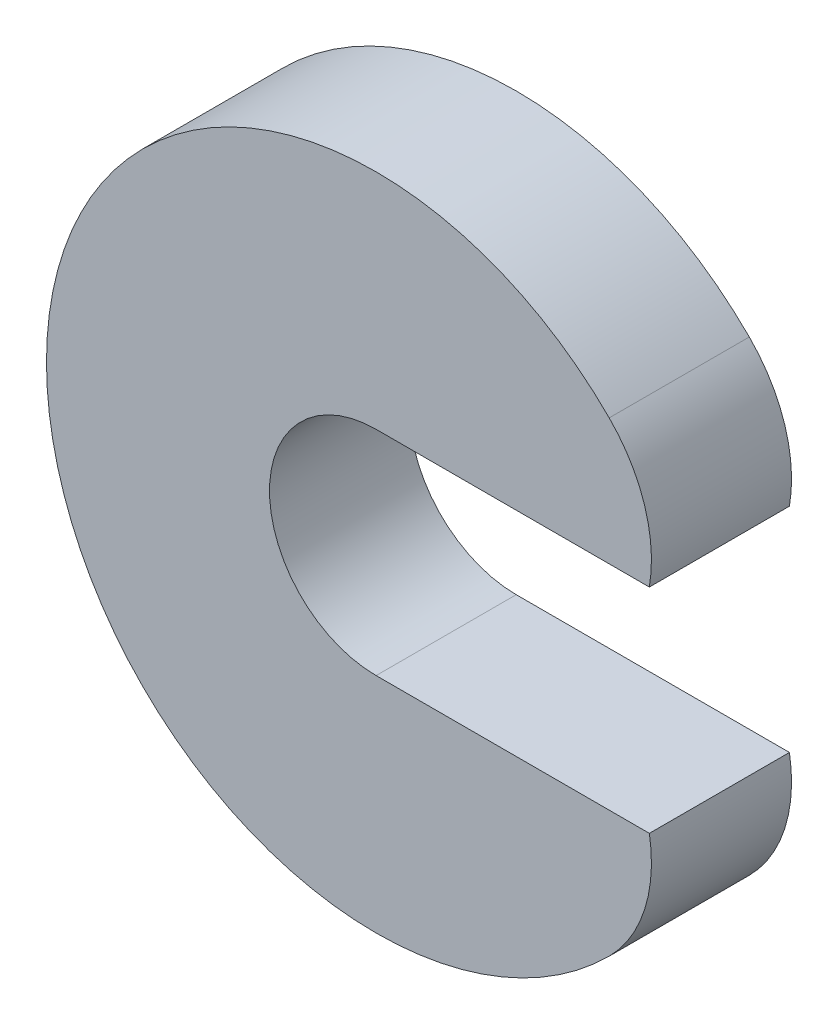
ISO-10303-21;
HEADER;
FILE_DESCRIPTION(('STEP AP214'),'2;1');
FILE_NAME('part.step','',(''),(''),'','','');
FILE_SCHEMA(('AUTOMOTIVE_DESIGN { 1 0 10303 214 1 1 1 1 }'));
ENDSEC;
DATA;
#1=APPLICATION_CONTEXT('core data for automotive mechanical design processes');
#2=APPLICATION_PROTOCOL_DEFINITION('international standard','automotive_design',2000,#1);
#3=PRODUCT_CONTEXT('',#1,'mechanical');
#4=PRODUCT('Part','Part','',(#3));
#5=PRODUCT_RELATED_PRODUCT_CATEGORY('part','',(#4));
#6=PRODUCT_DEFINITION_FORMATION('','',#4);
#7=PRODUCT_DEFINITION_CONTEXT('part definition',#1,'design');
#8=PRODUCT_DEFINITION('design','',#6,#7);
#9=PRODUCT_DEFINITION_SHAPE('','',#8);
#10=(LENGTH_UNIT() NAMED_UNIT(*) SI_UNIT(.MILLI.,.METRE.));
#11=(NAMED_UNIT(*) PLANE_ANGLE_UNIT() SI_UNIT($,.RADIAN.));
#12=(NAMED_UNIT(*) SI_UNIT($,.STERADIAN.) SOLID_ANGLE_UNIT());
#13=UNCERTAINTY_MEASURE_WITH_UNIT(LENGTH_MEASURE(1.E-05),#10,'distance_accuracy_value','');
#14=(GEOMETRIC_REPRESENTATION_CONTEXT(3) GLOBAL_UNCERTAINTY_ASSIGNED_CONTEXT((#13)) GLOBAL_UNIT_ASSIGNED_CONTEXT((#10,
#11,#12)) REPRESENTATION_CONTEXT('',''));
#15=CARTESIAN_POINT('',(0.,0.,0.));
#16=DIRECTION('',(0.,0.,1.));
#17=DIRECTION('',(1.,0.,0.));
#18=AXIS2_PLACEMENT_3D('',#15,#16,#17);
#19=CARTESIAN_POINT('',(159.099025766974,159.099025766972,170.));
#20=DIRECTION('',(0.,0.,-1.));
#21=DIRECTION('',(-1.,0.,0.));
#22=AXIS2_PLACEMENT_3D('',#19,#20,#21);
#23=CYLINDRICAL_SURFACE('',#22,175.);
#24=CARTESIAN_POINT('',(159.099025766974,159.099025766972,0.));
#25=DIRECTION('',(0.,0.,1.));
#26=DIRECTION('',(-1.,0.,0.));
#27=AXIS2_PLACEMENT_3D('',#24,#25,#26);
#28=CIRCLE('',#27,175.);
#29=CARTESIAN_POINT('',(331.55880310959,129.390017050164,0.));
#30=VERTEX_POINT('',#29);
#31=CARTESIAN_POINT('',(282.84271247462,282.842712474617,0.));
#32=VERTEX_POINT('',#31);
#33=EDGE_CURVE('E118',#30,#32,#28,.T.);
#34=ORIENTED_EDGE('',*,*,#33,.T.);
#35=DIRECTION('',(0.,0.,-1.));
#36=VECTOR('',#35,1.);
#37=CARTESIAN_POINT('',(282.84271247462,282.842712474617,170.));
#38=LINE('',#37,#36);
#39=CARTESIAN_POINT('',(282.84271247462,282.842712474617,170.));
#40=VERTEX_POINT('',#39);
#41=EDGE_CURVE('E11',#40,#32,#38,.T.);
#42=ORIENTED_EDGE('',*,*,#41,.F.);
#43=CARTESIAN_POINT('',(159.099025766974,159.099025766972,170.));
#44=DIRECTION('',(0.,0.,1.));
#45=DIRECTION('',(-1.,0.,0.));
#46=AXIS2_PLACEMENT_3D('',#43,#44,#45);
#47=CIRCLE('',#46,175.);
#48=CARTESIAN_POINT('',(331.55880310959,129.390017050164,170.));
#49=VERTEX_POINT('',#48);
#50=EDGE_CURVE('E130',#49,#40,#47,.T.);
#51=ORIENTED_EDGE('',*,*,#50,.F.);
#52=DIRECTION('',(0.,0.,-1.));
#53=VECTOR('',#52,1.);
#54=CARTESIAN_POINT('',(331.55880310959,129.390017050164,170.));
#55=LINE('',#54,#53);
#56=EDGE_CURVE('E114',#49,#30,#55,.T.);
#57=ORIENTED_EDGE('',*,*,#56,.T.);
#58=EDGE_LOOP('',(#34,#42,#51,#57));
#59=FACE_BOUND('',#58,.T.);
#60=ADVANCED_FACE('F34',(#59),#23,.T.);
#61=CARTESIAN_POINT('',(0.,0.,170.));
#62=DIRECTION('',(0.,0.,-1.));
#63=DIRECTION('',(-1.,0.,0.));
#64=AXIS2_PLACEMENT_3D('',#61,#62,#63);
#65=CYLINDRICAL_SURFACE('',#64,400.);
#66=CARTESIAN_POINT('',(0.,0.,0.));
#67=DIRECTION('',(0.,0.,1.));
#68=DIRECTION('',(1.,0.,0.));
#69=AXIS2_PLACEMENT_3D('',#66,#67,#68);
#70=CIRCLE('',#69,400.);
#71=CARTESIAN_POINT('',(282.842712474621,-282.842712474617,0.));
#72=VERTEX_POINT('',#71);
#73=EDGE_CURVE('E121',#32,#72,#70,.T.);
#74=ORIENTED_EDGE('',*,*,#73,.T.);
#75=DIRECTION('',(0.,0.,-1.));
#76=VECTOR('',#75,1.);
#77=CARTESIAN_POINT('',(282.842712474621,-282.842712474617,170.));
#78=LINE('',#77,#76);
#79=CARTESIAN_POINT('',(282.842712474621,-282.842712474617,170.));
#80=VERTEX_POINT('',#79);
#81=EDGE_CURVE('E42',#80,#72,#78,.T.);
#82=ORIENTED_EDGE('',*,*,#81,.F.);
#83=CARTESIAN_POINT('',(0.,0.,170.));
#84=DIRECTION('',(0.,0.,1.));
#85=DIRECTION('',(1.,0.,0.));
#86=AXIS2_PLACEMENT_3D('',#83,#84,#85);
#87=CIRCLE('',#86,400.);
#88=EDGE_CURVE('E85',#40,#80,#87,.T.);
#89=ORIENTED_EDGE('',*,*,#88,.F.);
#90=ORIENTED_EDGE('',*,*,#41,.T.);
#91=EDGE_LOOP('',(#74,#82,#89,#90));
#92=FACE_BOUND('',#91,.T.);
#93=ADVANCED_FACE('F144',(#92),#65,.T.);
#94=CARTESIAN_POINT('',(159.099025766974,-159.099025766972,170.));
#95=DIRECTION('',(0.,0.,-1.));
#96=DIRECTION('',(-1.,0.,0.));
#97=AXIS2_PLACEMENT_3D('',#94,#95,#96);
#98=CYLINDRICAL_SURFACE('',#97,175.);
#99=CARTESIAN_POINT('',(159.099025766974,-159.099025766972,0.));
#100=DIRECTION('',(0.,0.,1.));
#101=DIRECTION('',(1.,0.,0.));
#102=AXIS2_PLACEMENT_3D('',#99,#100,#101);
#103=CIRCLE('',#102,175.);
#104=CARTESIAN_POINT('',(331.55880310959,-129.390017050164,0.));
#105=VERTEX_POINT('',#104);
#106=EDGE_CURVE('E123',#72,#105,#103,.T.);
#107=ORIENTED_EDGE('',*,*,#106,.T.);
#108=DIRECTION('',(0.,0.,-1.));
#109=VECTOR('',#108,1.);
#110=CARTESIAN_POINT('',(331.55880310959,-129.390017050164,170.));
#111=LINE('',#110,#109);
#112=CARTESIAN_POINT('',(331.55880310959,-129.390017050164,170.));
#113=VERTEX_POINT('',#112);
#114=EDGE_CURVE('E109',#113,#105,#111,.T.);
#115=ORIENTED_EDGE('',*,*,#114,.F.);
#116=CARTESIAN_POINT('',(159.099025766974,-159.099025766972,170.));
#117=DIRECTION('',(0.,0.,1.));
#118=DIRECTION('',(1.,0.,0.));
#119=AXIS2_PLACEMENT_3D('',#116,#117,#118);
#120=CIRCLE('',#119,175.);
#121=EDGE_CURVE('E99',#80,#113,#120,.T.);
#122=ORIENTED_EDGE('',*,*,#121,.F.);
#123=ORIENTED_EDGE('',*,*,#81,.T.);
#124=EDGE_LOOP('',(#107,#115,#122,#123));
#125=FACE_BOUND('',#124,.T.);
#126=ADVANCED_FACE('F136',(#125),#98,.T.);
#127=CARTESIAN_POINT('',(0.,-129.390017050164,170.));
#128=DIRECTION('',(0.,-1.,0.));
#129=DIRECTION('',(0.,0.,-1.));
#130=AXIS2_PLACEMENT_3D('',#127,#128,#129);
#131=PLANE('',#130);
#132=DIRECTION('',(-1.,0.,0.));
#133=VECTOR('',#132,1.);
#134=CARTESIAN_POINT('',(0.,-129.390017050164,0.));
#135=LINE('',#134,#133);
#136=CARTESIAN_POINT('',(0.,-129.390017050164,0.));
#137=VERTEX_POINT('',#136);
#138=EDGE_CURVE('E107',#105,#137,#135,.T.);
#139=ORIENTED_EDGE('',*,*,#138,.T.);
#140=DIRECTION('',(0.,0.,-1.));
#141=VECTOR('',#140,1.);
#142=CARTESIAN_POINT('',(0.,-129.390017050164,170.));
#143=LINE('',#142,#141);
#144=CARTESIAN_POINT('',(0.,-129.390017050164,170.));
#145=VERTEX_POINT('',#144);
#146=EDGE_CURVE('E105',#145,#137,#143,.T.);
#147=ORIENTED_EDGE('',*,*,#146,.F.);
#148=DIRECTION('',(-1.,0.,0.));
#149=VECTOR('',#148,1.);
#150=CARTESIAN_POINT('',(310.,-129.390017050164,170.));
#151=LINE('',#150,#149);
#152=EDGE_CURVE('E92',#113,#145,#151,.T.);
#153=ORIENTED_EDGE('',*,*,#152,.F.);
#154=ORIENTED_EDGE('',*,*,#114,.T.);
#155=EDGE_LOOP('',(#139,#147,#153,#154));
#156=FACE_BOUND('',#155,.T.);
#157=ADVANCED_FACE('F106',(#156),#131,.F.);
#158=CARTESIAN_POINT('',(0.,0.,170.));
#159=DIRECTION('',(0.,0.,-1.));
#160=DIRECTION('',(-1.,0.,0.));
#161=AXIS2_PLACEMENT_3D('',#158,#159,#160);
#162=CYLINDRICAL_SURFACE('',#161,129.390017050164);
#163=CARTESIAN_POINT('',(0.,0.,0.));
#164=DIRECTION('',(0.,0.,-1.));
#165=DIRECTION('',(1.,0.,0.));
#166=AXIS2_PLACEMENT_3D('',#163,#164,#165);
#167=CIRCLE('',#166,129.390017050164);
#168=CARTESIAN_POINT('',(0.,129.390017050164,0.));
#169=VERTEX_POINT('',#168);
#170=EDGE_CURVE('E127',#137,#169,#167,.T.);
#171=ORIENTED_EDGE('',*,*,#170,.T.);
#172=DIRECTION('',(0.,0.,-1.));
#173=VECTOR('',#172,1.);
#174=CARTESIAN_POINT('',(0.,129.390017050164,170.));
#175=LINE('',#174,#173);
#176=CARTESIAN_POINT('',(0.,129.390017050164,170.));
#177=VERTEX_POINT('',#176);
#178=EDGE_CURVE('E110',#177,#169,#175,.T.);
#179=ORIENTED_EDGE('',*,*,#178,.F.);
#180=CARTESIAN_POINT('',(0.,0.,170.));
#181=DIRECTION('',(0.,0.,-1.));
#182=DIRECTION('',(1.,0.,0.));
#183=AXIS2_PLACEMENT_3D('',#180,#181,#182);
#184=CIRCLE('',#183,129.390017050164);
#185=EDGE_CURVE('E96',#145,#177,#184,.T.);
#186=ORIENTED_EDGE('',*,*,#185,.F.);
#187=ORIENTED_EDGE('',*,*,#146,.T.);
#188=EDGE_LOOP('',(#171,#179,#186,#187));
#189=FACE_BOUND('',#188,.T.);
#190=ADVANCED_FACE('F112',(#189),#162,.F.);
#191=CARTESIAN_POINT('',(310.,129.390017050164,170.));
#192=DIRECTION('',(0.,1.,0.));
#193=DIRECTION('',(0.,0.,1.));
#194=AXIS2_PLACEMENT_3D('',#191,#192,#193);
#195=PLANE('',#194);
#196=DIRECTION('',(1.,0.,0.));
#197=VECTOR('',#196,1.);
#198=CARTESIAN_POINT('',(310.,129.390017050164,0.));
#199=LINE('',#198,#197);
#200=EDGE_CURVE('E73',#169,#30,#199,.T.);
#201=ORIENTED_EDGE('',*,*,#200,.T.);
#202=ORIENTED_EDGE('',*,*,#56,.F.);
#203=DIRECTION('',(1.,0.,0.));
#204=VECTOR('',#203,1.);
#205=CARTESIAN_POINT('',(310.,129.390017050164,170.));
#206=LINE('',#205,#204);
#207=EDGE_CURVE('E50',#177,#49,#206,.T.);
#208=ORIENTED_EDGE('',*,*,#207,.F.);
#209=ORIENTED_EDGE('',*,*,#178,.T.);
#210=EDGE_LOOP('',(#201,#202,#208,#209));
#211=FACE_BOUND('',#210,.T.);
#212=ADVANCED_FACE('F138',(#211),#195,.F.);
#213=CARTESIAN_POINT('',(159.099025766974,159.099025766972,170.));
#214=DIRECTION('',(0.,0.,-1.));
#215=DIRECTION('',(-1.,0.,0.));
#216=AXIS2_PLACEMENT_3D('',#213,#214,#215);
#217=PLANE('',#216);
#218=ORIENTED_EDGE('',*,*,#50,.T.);
#219=ORIENTED_EDGE('',*,*,#88,.T.);
#220=ORIENTED_EDGE('',*,*,#121,.T.);
#221=ORIENTED_EDGE('',*,*,#152,.T.);
#222=ORIENTED_EDGE('',*,*,#185,.T.);
#223=ORIENTED_EDGE('',*,*,#207,.T.);
#224=EDGE_LOOP('',(#218,#219,#220,#221,#222,#223));
#225=FACE_BOUND('',#224,.T.);
#226=ADVANCED_FACE('F94',(#225),#217,.F.);
#227=CARTESIAN_POINT('',(159.099025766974,159.099025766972,0.));
#228=DIRECTION('',(0.,0.,-1.));
#229=DIRECTION('',(-1.,0.,0.));
#230=AXIS2_PLACEMENT_3D('',#227,#228,#229);
#231=PLANE('',#230);
#232=ORIENTED_EDGE('',*,*,#33,.F.);
#233=ORIENTED_EDGE('',*,*,#200,.F.);
#234=ORIENTED_EDGE('',*,*,#170,.F.);
#235=ORIENTED_EDGE('',*,*,#138,.F.);
#236=ORIENTED_EDGE('',*,*,#106,.F.);
#237=ORIENTED_EDGE('',*,*,#73,.F.);
#238=EDGE_LOOP('',(#232,#233,#234,#235,#236,#237));
#239=FACE_BOUND('',#238,.T.);
#240=ADVANCED_FACE('F137',(#239),#231,.T.);
#241=CLOSED_SHELL('',(#60,#93,#126,#157,#190,#212,#226,#240));
#242=MANIFOLD_SOLID_BREP('B2',#241);
#243=ADVANCED_BREP_SHAPE_REPRESENTATION('',(#18,#242),#14);
#244=SHAPE_DEFINITION_REPRESENTATION(#9,#243);
ENDSEC;
END-ISO-10303-21;
